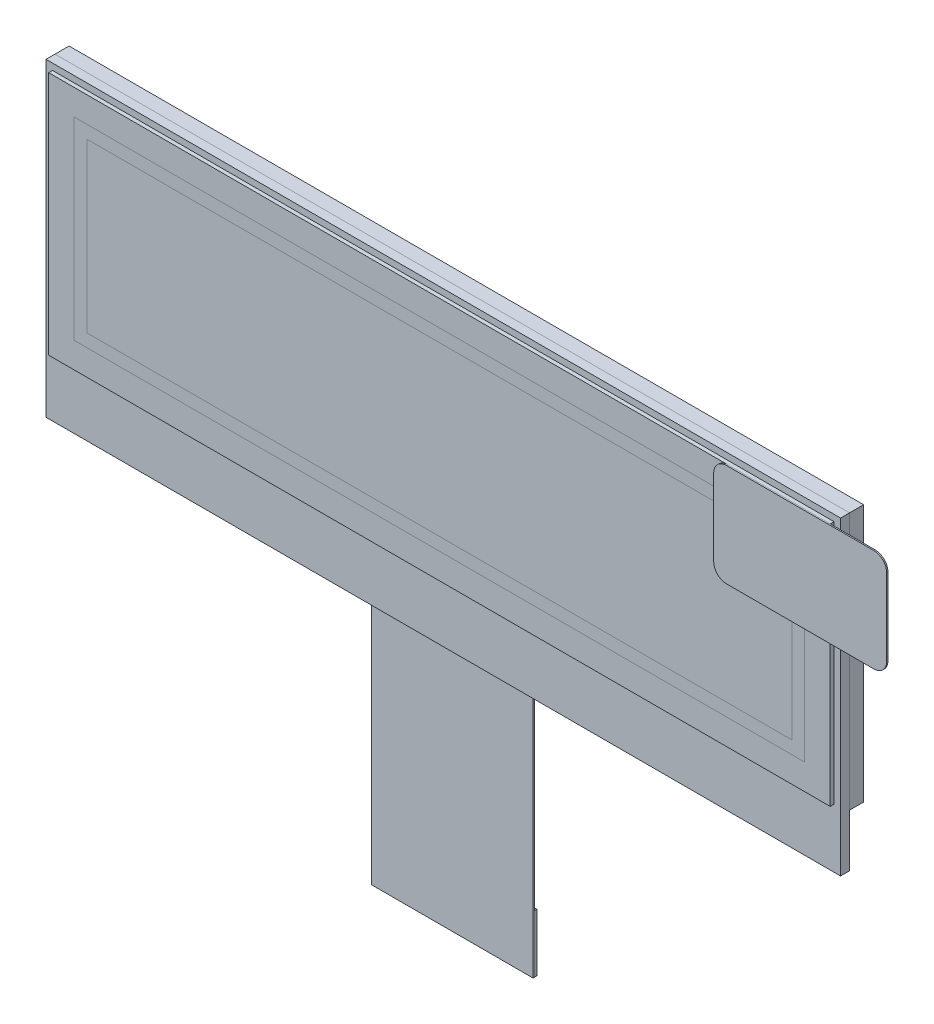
from build123d import *

# Parameters (mm, degrees)
SKETCH4_W             = 62.02
SKETCH4_H             = 4.1
SKETCH4_H_2           = 20.1
SKETCH4_W_2           = 61
SKETCH4_H_3           = 19.1
SKETCH4_W_3           = 57.02
SKETCH4_H_4           = 15.1
SKETCH4_W_4           = 55.016
SKETCH4_H_5           = 13.096
BOSS_EXTRUDE1_DEPTH   = 0.7
SKETCH4_3_W           = 62.02
SKETCH4_3_H           = 20.1
SKETCH4_3_W_2         = 61
SKETCH4_3_H_2         = 19.1
SKETCH4_3_W_3         = 57.02
SKETCH4_3_H_3         = 15.1
SKETCH4_3_W_4         = 55.016
SKETCH4_3_H_4         = 13.096
BOSS_EXTRUDE2_DEPTH   = 1.1
BOSS_EXTRUDE3_START   = -1.1
SKETCH4_4_W           = 61
SKETCH4_4_H           = 19.1
SKETCH4_4_W_2         = 57.02
SKETCH4_4_H_2         = 15.1
SKETCH4_4_W_3         = 55.016
SKETCH4_4_H_3         = 13.096
BOSS_EXTRUDE3_DEPTH   = 0.15
BOSS_EXTRUDE4_START   = 0.7
SKETCH4_5_W           = 61
SKETCH4_5_H           = 19.1
SKETCH4_5_W_2         = 57.02
SKETCH4_5_H_2         = 15.1
SKETCH4_5_W_3         = 55.016
SKETCH4_5_H_3         = 13.096
BOSS_EXTRUDE4_DEPTH   = 0.3
BOSS_EXTRUDE5_DEPTH   = 0.1
SKETCH7_W             = 12.6
SKETCH7_H             = 20.6
BOSS_EXTRUDE6_DEPTH   = 0.1
SKETCH8_W             = 12.6
SKETCH8_H             = 4.5
BOSS_EXTRUDE7_DEPTH   = 0.2
BOSS_EXTRUDE8_DEPTH   = 6.3
BOSS_EXTRUDE8_2_DEPTH = 6.3
BOSS_EXTRUDE9_DEPTH   = 10


with BuildPart() as part:
    # Sketch4 → Boss-Extrude1 (new body)
    # profile 1 of 5: a face of its own
    with BuildSketch(Plane.XY):
        with Locations((0, -12.1)):
            Rectangle(SKETCH4_W, SKETCH4_H)
    # profile 2 of 5: a face of its own
    with BuildSketch(Plane.XY):
        Rectangle(SKETCH4_W, SKETCH4_H_2)
        Rectangle(SKETCH4_W_2, SKETCH4_H_3, mode=Mode.SUBTRACT)
    # profile 3 of 5: a face of its own
    with BuildSketch(Plane.XY):
        Rectangle(SKETCH4_W_2, SKETCH4_H_3)
        Rectangle(SKETCH4_W_3, SKETCH4_H_4, mode=Mode.SUBTRACT)
    # profile 4 of 5: a face of its own
    with BuildSketch(Plane.XY):
        Rectangle(SKETCH4_W_3, SKETCH4_H_4)
        Rectangle(SKETCH4_W_4, SKETCH4_H_5, mode=Mode.SUBTRACT)
    # profile 5 of 5: a face of its own
    with BuildSketch(Plane.XY):
        Rectangle(SKETCH4_W_4, SKETCH4_H_5)
    extrude(amount=BOSS_EXTRUDE1_DEPTH)

    # Sketch7 → Boss-Extrude6 (add)
    with BuildSketch(Plane(origin=(0, 0, 0), x_dir=(-1, 0, 0), z_dir=(0, 0, -1))):
        with Locations((0, -23.45)):
            Rectangle(SKETCH7_W, SKETCH7_H)
    extrude(amount=BOSS_EXTRUDE6_DEPTH)


with BuildPart() as body_2:
    # Sketch4_3 → Boss-Extrude2 (new body)
    # profile 1 of 4: a face of its own
    with BuildSketch(Plane.XY):
        Rectangle(SKETCH4_3_W, SKETCH4_3_H)
        Rectangle(SKETCH4_3_W_2, SKETCH4_3_H_2, mode=Mode.SUBTRACT)
    # profile 2 of 4: a face of its own
    with BuildSketch(Plane.XY):
        Rectangle(SKETCH4_3_W_2, SKETCH4_3_H_2)
        Rectangle(SKETCH4_3_W_3, SKETCH4_3_H_3, mode=Mode.SUBTRACT)
    # profile 3 of 4: a face of its own
    with BuildSketch(Plane.XY):
        Rectangle(SKETCH4_3_W_3, SKETCH4_3_H_3)
        Rectangle(SKETCH4_3_W_4, SKETCH4_3_H_4, mode=Mode.SUBTRACT)
    # profile 4 of 4: a face of its own
    with BuildSketch(Plane.XY):
        Rectangle(SKETCH4_3_W_4, SKETCH4_3_H_4)
    extrude(amount=-BOSS_EXTRUDE2_DEPTH)


with BuildPart() as body_3:
    # Sketch4_4 → Boss-Extrude3 (new body)
    # profile 1 of 3: a face of its own
    with BuildSketch(Plane.XY.offset(BOSS_EXTRUDE3_START)):
        Rectangle(SKETCH4_4_W, SKETCH4_4_H)
        Rectangle(SKETCH4_4_W_2, SKETCH4_4_H_2, mode=Mode.SUBTRACT)
    # profile 2 of 3: a face of its own
    with BuildSketch(Plane.XY.offset(BOSS_EXTRUDE3_START)):
        Rectangle(SKETCH4_4_W_2, SKETCH4_4_H_2)
        Rectangle(SKETCH4_4_W_3, SKETCH4_4_H_3, mode=Mode.SUBTRACT)
    # profile 3 of 3: a face of its own
    with BuildSketch(Plane.XY.offset(BOSS_EXTRUDE3_START)):
        Rectangle(SKETCH4_4_W_3, SKETCH4_4_H_3)
    extrude(amount=-BOSS_EXTRUDE3_DEPTH)


with BuildPart() as body_4:
    # Sketch4_5 → Boss-Extrude4 (new body)
    # profile 1 of 3: a face of its own
    with BuildSketch(Plane.XY.offset(BOSS_EXTRUDE4_START)):
        Rectangle(SKETCH4_5_W, SKETCH4_5_H)
        Rectangle(SKETCH4_5_W_2, SKETCH4_5_H_2, mode=Mode.SUBTRACT)
    # profile 2 of 3: a face of its own
    with BuildSketch(Plane.XY.offset(BOSS_EXTRUDE4_START)):
        Rectangle(SKETCH4_5_W_2, SKETCH4_5_H_2)
        Rectangle(SKETCH4_5_W_3, SKETCH4_5_H_3, mode=Mode.SUBTRACT)
    # profile 3 of 3: a face of its own
    with BuildSketch(Plane.XY.offset(BOSS_EXTRUDE4_START)):
        Rectangle(SKETCH4_5_W_3, SKETCH4_5_H_3)
    extrude(amount=BOSS_EXTRUDE4_DEPTH)


with BuildPart() as body_5:
    # Sketch6 → Boss-Extrude5 (new body)
    with BuildSketch(Plane.XY.offset(1)):
        with BuildLine():
            Line((22.508, 9.55), (34.01, 9.55))
            ThreePointArc((34.01, 9.55), (34.717106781, 9.257106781), (35.01, 8.55))
            Line((35.01, 8.55), (35.01, 2.548))
            ThreePointArc((35.01, 2.548), (34.717106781, 1.840893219), (34.01, 1.548))
            Line((34.01, 1.548), (22.508, 1.548))
            ThreePointArc((22.508, 1.548), (21.800893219, 1.840893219), (21.508, 2.548))
            Line((21.508, 2.548), (21.508, 8.55))
            ThreePointArc((21.508, 8.55), (21.800893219, 9.257106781), (22.508, 9.55))
        make_face()
    extrude(amount=BOSS_EXTRUDE5_DEPTH)


with BuildPart() as body_6:
    # Sketch8 → Boss-Extrude7 (new body)
    with BuildSketch(Plane(origin=(0, 0, -0.1), x_dir=(-1, 0, 0), z_dir=(0, 0, -1))):
        with Locations((0, -31.5)):
            Rectangle(SKETCH8_W, SKETCH8_H)
    extrude(amount=BOSS_EXTRUDE7_DEPTH)


with BuildPart() as body_7:
    # Sketch9 → Boss-Extrude8 (new, symmetric)
    with BuildSketch(Plane(origin=(0, 0, 0), x_dir=(0, 0, -1), z_dir=(1, 0, 0))):
        with BuildLine():
            Line((0, -13.15), (0.1, -13.15))
            ThreePointArc((0.1, -13.15), (0.843814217, -11.678649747), (1.1, -10.05))
            Line((1.1, -10.05), (0, -10.05))
            Line((0, -10.05), (0, -13.15))
        make_face()
    extrude(amount=BOSS_EXTRUDE8_DEPTH, both=True)

    # Sketch9_2 → Boss-Extrude9 (add, symmetric)
    with BuildSketch(Plane(origin=(0, 0, 0), x_dir=(0, 0, -1), z_dir=(1, 0, 0))):
        with BuildLine():
            Line((0, -13.15), (0.1, -13.15))
            ThreePointArc((0.1, -13.15), (0.843814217, -11.678649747), (1.1, -10.05))
            Line((1.1, -10.05), (0, -10.05))
            Line((0, -10.05), (0, -13.15))
        make_face()
    extrude(amount=BOSS_EXTRUDE9_DEPTH, both=True)


with BuildPart() as body_8:
    # Sketch9 → Boss-Extrude8 2 (new, symmetric)
    with BuildSketch(Plane(origin=(0, 0, 0), x_dir=(0, 0, -1), z_dir=(1, 0, 0))):
        Polygon((-0.7, -14.15), (0, -14.85), (0, -14.15), align=None)
    extrude(amount=BOSS_EXTRUDE8_2_DEPTH, both=True)


solid = Compound([part.part, body_2.part, body_3.part, body_4.part, body_5.part, body_6.part, body_7.part, body_8.part])
